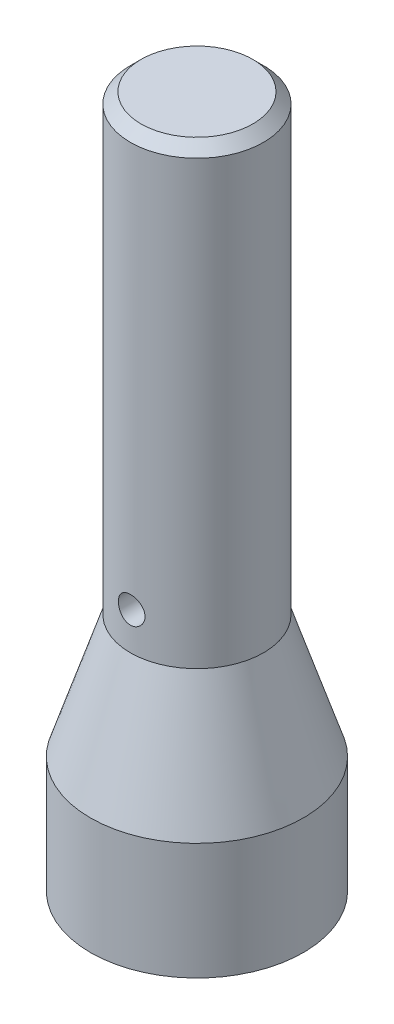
ISO-10303-21;
HEADER;
FILE_DESCRIPTION(('STEP AP214'),'2;1');
FILE_NAME('part.step','',(''),(''),'','','');
FILE_SCHEMA(('AUTOMOTIVE_DESIGN { 1 0 10303 214 1 1 1 1 }'));
ENDSEC;
DATA;
#1=APPLICATION_CONTEXT('core data for automotive mechanical design processes');
#2=APPLICATION_PROTOCOL_DEFINITION('international standard','automotive_design',2000,#1);
#3=PRODUCT_CONTEXT('',#1,'mechanical');
#4=PRODUCT('Part','Part','',(#3));
#5=PRODUCT_RELATED_PRODUCT_CATEGORY('part','',(#4));
#6=PRODUCT_DEFINITION_FORMATION('','',#4);
#7=PRODUCT_DEFINITION_CONTEXT('part definition',#1,'design');
#8=PRODUCT_DEFINITION('design','',#6,#7);
#9=PRODUCT_DEFINITION_SHAPE('','',#8);
#10=(LENGTH_UNIT() NAMED_UNIT(*) SI_UNIT(.MILLI.,.METRE.));
#11=(NAMED_UNIT(*) PLANE_ANGLE_UNIT() SI_UNIT($,.RADIAN.));
#12=(NAMED_UNIT(*) SI_UNIT($,.STERADIAN.) SOLID_ANGLE_UNIT());
#13=UNCERTAINTY_MEASURE_WITH_UNIT(LENGTH_MEASURE(1.E-05),#10,'distance_accuracy_value','');
#14=(GEOMETRIC_REPRESENTATION_CONTEXT(3) GLOBAL_UNCERTAINTY_ASSIGNED_CONTEXT((#13)) GLOBAL_UNIT_ASSIGNED_CONTEXT((#10,
#11,#12)) REPRESENTATION_CONTEXT('',''));
#15=CARTESIAN_POINT('',(0.,0.,0.));
#16=DIRECTION('',(0.,0.,1.));
#17=DIRECTION('',(1.,0.,0.));
#18=AXIS2_PLACEMENT_3D('',#15,#16,#17);
#19=CARTESIAN_POINT('',(0.,4.5,0.));
#20=DIRECTION('',(0.,-1.,0.));
#21=DIRECTION('',(0.,0.,-1.));
#22=AXIS2_PLACEMENT_3D('',#19,#20,#21);
#23=CYLINDRICAL_SURFACE('',#22,2.);
#24=CARTESIAN_POINT('',(0.,2.18999999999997,0.));
#25=DIRECTION('',(0.,1.,0.));
#26=DIRECTION('',(0.,0.,1.));
#27=AXIS2_PLACEMENT_3D('',#24,#25,#26);
#28=CIRCLE('',#27,2.);
#29=CARTESIAN_POINT('',(0.,2.18999999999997,2.));
#30=VERTEX_POINT('',#29);
#31=EDGE_CURVE('E145',#30,#30,#28,.F.);
#32=ORIENTED_EDGE('',*,*,#31,.T.);
#33=EDGE_LOOP('',(#32));
#34=FACE_BOUND('',#33,.T.);
#35=CARTESIAN_POINT('',(0.,0.,0.));
#36=DIRECTION('',(0.,1.,0.));
#37=DIRECTION('',(0.,0.,1.));
#38=AXIS2_PLACEMENT_3D('',#35,#36,#37);
#39=CIRCLE('',#38,2.);
#40=CARTESIAN_POINT('',(0.,0.,2.));
#41=VERTEX_POINT('',#40);
#42=EDGE_CURVE('E73',#41,#41,#39,.T.);
#43=ORIENTED_EDGE('',*,*,#42,.T.);
#44=EDGE_LOOP('',(#43));
#45=FACE_BOUND('',#44,.T.);
#46=ADVANCED_FACE('F34',(#34,#45),#23,.T.);
#47=CARTESIAN_POINT('',(0.,0.,0.));
#48=DIRECTION('',(0.,1.,0.));
#49=DIRECTION('',(0.,0.,1.));
#50=AXIS2_PLACEMENT_3D('',#47,#48,#49);
#51=PLANE('',#50);
#52=CARTESIAN_POINT('',(0.,0.,0.));
#53=DIRECTION('',(0.,-1.,0.));
#54=DIRECTION('',(0.,0.,-1.));
#55=AXIS2_PLACEMENT_3D('',#52,#53,#54);
#56=CIRCLE('',#55,0.79999999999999);
#57=CARTESIAN_POINT('',(0.,0.,-0.79999999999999));
#58=VERTEX_POINT('',#57);
#59=EDGE_CURVE('E58',#58,#58,#56,.T.);
#60=ORIENTED_EDGE('',*,*,#59,.F.);
#61=EDGE_LOOP('',(#60));
#62=FACE_BOUND('',#61,.T.);
#63=ORIENTED_EDGE('',*,*,#42,.F.);
#64=EDGE_LOOP('',(#63));
#65=FACE_BOUND('',#64,.T.);
#66=ADVANCED_FACE('F98',(#62,#65),#51,.F.);
#67=CARTESIAN_POINT('',(0.,4.5,0.));
#68=DIRECTION('',(0.,-1.,0.));
#69=DIRECTION('',(0.,0.,-1.));
#70=AXIS2_PLACEMENT_3D('',#67,#68,#69);
#71=CONICAL_SURFACE('',#70,1.24943550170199,0.314159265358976);
#72=ORIENTED_EDGE('',*,*,#31,.F.);
#73=EDGE_LOOP('',(#72));
#74=FACE_BOUND('',#73,.T.);
#75=CARTESIAN_POINT('',(0.,4.5,0.));
#76=DIRECTION('',(0.,1.,0.));
#77=DIRECTION('',(0.,0.,1.));
#78=AXIS2_PLACEMENT_3D('',#75,#76,#77);
#79=CIRCLE('',#78,1.25);
#80=CARTESIAN_POINT('',(0.,4.5,1.25));
#81=VERTEX_POINT('',#80);
#82=EDGE_CURVE('E78',#81,#81,#79,.T.);
#83=ORIENTED_EDGE('',*,*,#82,.F.);
#84=EDGE_LOOP('',(#83));
#85=FACE_BOUND('',#84,.T.);
#86=ADVANCED_FACE('F95',(#74,#85),#71,.T.);
#87=CARTESIAN_POINT('',(0.,13.,0.));
#88=DIRECTION('',(0.,-1.,0.));
#89=DIRECTION('',(0.,0.,-1.));
#90=AXIS2_PLACEMENT_3D('',#87,#88,#89);
#91=CYLINDRICAL_SURFACE('',#90,1.25);
#92=CARTESIAN_POINT('',(0.,12.8,0.));
#93=DIRECTION('',(0.,1.,0.));
#94=DIRECTION('',(0.,0.,1.));
#95=AXIS2_PLACEMENT_3D('',#92,#93,#94);
#96=CIRCLE('',#95,1.25);
#97=CARTESIAN_POINT('',(0.,12.8,1.25));
#98=VERTEX_POINT('',#97);
#99=EDGE_CURVE('E11',#98,#98,#96,.F.);
#100=ORIENTED_EDGE('',*,*,#99,.T.);
#101=EDGE_LOOP('',(#100));
#102=FACE_BOUND('',#101,.T.);
#103=CARTESIAN_POINT('',(-0.249999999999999,5.2,1.22474487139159));
#104=CARTESIAN_POINT('',(-0.24999948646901,5.21389109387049,1.22474514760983));
#105=CARTESIAN_POINT('',(-0.248838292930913,5.22778865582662,1.22498377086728));
#106=CARTESIAN_POINT('',(-0.244228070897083,5.2551906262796,1.22591107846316));
#107=CARTESIAN_POINT('',(-0.240777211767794,5.26869471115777,1.22660012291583));
#108=CARTESIAN_POINT('',(-0.231698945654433,5.29490932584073,1.22834718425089));
#109=CARTESIAN_POINT('',(-0.226073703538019,5.30762063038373,1.22940483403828));
#110=CARTESIAN_POINT('',(-0.212812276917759,5.33191871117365,1.23176949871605));
#111=CARTESIAN_POINT('',(-0.205176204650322,5.34350555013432,1.23307649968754));
#112=CARTESIAN_POINT('',(-0.187994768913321,5.36539025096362,1.2358132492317));
#113=CARTESIAN_POINT('',(-0.178426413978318,5.37566989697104,1.23724434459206));
#114=CARTESIAN_POINT('',(-0.157701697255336,5.3944893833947,1.24005618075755));
#115=CARTESIAN_POINT('',(-0.146545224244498,5.40302910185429,1.24143691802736));
#116=CARTESIAN_POINT('',(-0.12284033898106,5.41819700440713,1.24400699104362));
#117=CARTESIAN_POINT('',(-0.110280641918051,5.42480787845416,1.2451945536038));
#118=CARTESIAN_POINT('',(-0.0842010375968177,5.43581873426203,1.24722934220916));
#119=CARTESIAN_POINT('',(-0.0706812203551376,5.44021892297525,1.24807660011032));
#120=CARTESIAN_POINT('',(-0.0432541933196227,5.44662679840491,1.24932580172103));
#121=CARTESIAN_POINT('',(-0.0293544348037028,5.44866524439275,1.24973346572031));
#122=CARTESIAN_POINT('',(-0.00140464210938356,5.45038773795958,1.25007730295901));
#123=CARTESIAN_POINT('',(0.0126453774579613,5.45007201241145,1.2500135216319));
#124=CARTESIAN_POINT('',(0.0402855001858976,5.44711845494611,1.24942608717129));
#125=CARTESIAN_POINT('',(0.053879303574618,5.44451375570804,1.2489089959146));
#126=CARTESIAN_POINT('',(0.0804329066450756,5.43710874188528,1.24748044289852));
#127=CARTESIAN_POINT('',(0.0933926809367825,5.43230833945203,1.2465689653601));
#128=CARTESIAN_POINT('',(0.118404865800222,5.42061748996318,1.2444432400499));
#129=CARTESIAN_POINT('',(0.130451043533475,5.41371406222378,1.24322712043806));
#130=CARTESIAN_POINT('',(0.153226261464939,5.39802273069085,1.24062617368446));
#131=CARTESIAN_POINT('',(0.16395514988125,5.38923461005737,1.23924132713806));
#132=CARTESIAN_POINT('',(0.183987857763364,5.36984159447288,1.23642741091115));
#133=CARTESIAN_POINT('',(0.193263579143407,5.3592077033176,1.23499799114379));
#134=CARTESIAN_POINT('',(0.209904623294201,5.33652088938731,1.2322789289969));
#135=CARTESIAN_POINT('',(0.217269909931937,5.3244679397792,1.23098928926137));
#136=CARTESIAN_POINT('',(0.22989070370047,5.29924479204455,1.22869511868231));
#137=CARTESIAN_POINT('',(0.235141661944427,5.28607225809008,1.22769120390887));
#138=CARTESIAN_POINT('',(0.243347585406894,5.259007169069,1.22609119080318));
#139=CARTESIAN_POINT('',(0.24630284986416,5.24511470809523,1.22549503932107));
#140=CARTESIAN_POINT('',(0.249791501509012,5.21725878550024,1.22478869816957));
#141=CARTESIAN_POINT('',(0.250365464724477,5.20330060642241,1.22467036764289));
#142=CARTESIAN_POINT('',(0.249184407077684,5.17548794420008,1.22491121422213));
#143=CARTESIAN_POINT('',(0.247429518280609,5.16163345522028,1.22527036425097));
#144=CARTESIAN_POINT('',(0.241675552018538,5.13455783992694,1.22641808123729));
#145=CARTESIAN_POINT('',(0.237698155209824,5.12133191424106,1.22720249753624));
#146=CARTESIAN_POINT('',(0.227635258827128,5.09573418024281,1.22910872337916));
#147=CARTESIAN_POINT('',(0.221549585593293,5.08336244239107,1.23023056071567));
#148=CARTESIAN_POINT('',(0.207351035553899,5.05964672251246,1.2327035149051));
#149=CARTESIAN_POINT('',(0.199212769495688,5.04831823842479,1.23405742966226));
#150=CARTESIAN_POINT('',(0.181173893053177,5.02717292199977,1.23683430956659));
#151=CARTESIAN_POINT('',(0.171273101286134,5.01735624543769,1.23825728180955));
#152=CARTESIAN_POINT('',(0.149808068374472,4.99935936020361,1.24103836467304));
#153=CARTESIAN_POINT('',(0.138220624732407,4.9912065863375,1.24239514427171));
#154=CARTESIAN_POINT('',(0.113816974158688,4.97696352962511,1.24486781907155));
#155=CARTESIAN_POINT('',(0.101000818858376,4.97087316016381,1.24598372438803));
#156=CARTESIAN_POINT('',(0.0745756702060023,4.96096778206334,1.24784323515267));
#157=CARTESIAN_POINT('',(0.0609716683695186,4.95713987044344,1.24858894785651));
#158=CARTESIAN_POINT('',(0.0332973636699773,4.95182718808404,1.24963308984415));
#159=CARTESIAN_POINT('',(0.0192271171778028,4.95034213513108,1.24993157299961));
#160=CARTESIAN_POINT('',(-0.00871822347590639,4.94976825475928,1.2500463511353));
#161=CARTESIAN_POINT('',(-0.022592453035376,4.95063817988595,1.24987094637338));
#162=CARTESIAN_POINT('',(-0.0499927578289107,4.95465848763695,1.24907510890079));
#163=CARTESIAN_POINT('',(-0.0635188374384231,4.95780884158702,1.24845468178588));
#164=CARTESIAN_POINT('',(-0.0898131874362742,4.96628224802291,1.2468387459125));
#165=CARTESIAN_POINT('',(-0.10258311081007,4.9716003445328,1.24584409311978));
#166=CARTESIAN_POINT('',(-0.127055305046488,4.98425306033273,1.24358680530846));
#167=CARTESIAN_POINT('',(-0.138757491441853,4.99158783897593,1.24232414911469));
#168=CARTESIAN_POINT('',(-0.160965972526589,5.00820484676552,1.23964399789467));
#169=CARTESIAN_POINT('',(-0.171449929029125,5.01751658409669,1.23822433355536));
#170=CARTESIAN_POINT('',(-0.190720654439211,5.03776256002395,1.23540305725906));
#171=CARTESIAN_POINT('',(-0.199507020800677,5.04869718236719,1.23400144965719));
#172=CARTESIAN_POINT('',(-0.2152230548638,5.07201982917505,1.23135835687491));
#173=CARTESIAN_POINT('',(-0.222131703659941,5.08442224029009,1.23011875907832));
#174=CARTESIAN_POINT('',(-0.233756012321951,5.11023319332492,1.22796309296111));
#175=CARTESIAN_POINT('',(-0.238473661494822,5.12364080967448,1.22704673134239));
#176=CARTESIAN_POINT('',(-0.244667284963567,5.14756561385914,1.2258242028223));
#177=CARTESIAN_POINT('',(-0.246663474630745,5.15794635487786,1.22542196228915));
#178=CARTESIAN_POINT('',(-0.249330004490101,5.17888348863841,1.22488219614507));
#179=CARTESIAN_POINT('',(-0.250000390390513,5.18943987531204,1.22474466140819));
#180=CARTESIAN_POINT('',(-0.249999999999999,5.2,1.22474487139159));
#181=B_SPLINE_CURVE_WITH_KNOTS('',3,(#103,#104,#105,#106,#107,#108,#109,#110,#111,#112,#113,
#114,#115,#116,#117,#118,#119,#120,#121,#122,#123,#124,#125,#126,#127,#128,#129,#130,#131,#132,
#133,#134,#135,#136,#137,#138,#139,#140,#141,#142,#143,#144,#145,#146,#147,#148,#149,#150,#151,
#152,#153,#154,#155,#156,#157,#158,#159,#160,#161,#162,#163,#164,#165,#166,#167,#168,#169,#170,
#171,#172,#173,#174,#175,#176,#177,#178,#179,#180),.UNSPECIFIED.,.T.,.F.,(4,2,2,2,2,2,2,2,2,2,2,
2,2,2,2,2,2,2,2,2,2,2,2,2,2,2,2,2,2,2,2,2,2,2,2,2,2,2,4),(0.,0.0416346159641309,
0.0833025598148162,0.124929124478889,0.166553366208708,0.208705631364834,0.250860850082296,
0.293383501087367,0.33590217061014,0.377860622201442,0.419815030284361,0.461171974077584,
0.502530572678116,0.544149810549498,0.585773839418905,0.628123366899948,0.67047369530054,
0.712914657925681,0.755350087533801,0.797059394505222,0.838766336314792,0.880073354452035,
0.921383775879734,0.96323264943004,1.00508583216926,1.04758150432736,1.090075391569,
1.13232453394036,1.17456858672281,1.21607754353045,1.25758597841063,1.29900004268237,
1.34041738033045,1.38250288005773,1.42459834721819,1.46714724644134,1.50965743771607,
1.54130950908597,1.57296048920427),.UNSPECIFIED.);
#182=CARTESIAN_POINT('',(-0.249999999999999,5.2,1.22474487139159));
#183=VERTEX_POINT('',#182);
#184=EDGE_CURVE('E61',#183,#183,#181,.T.);
#185=ORIENTED_EDGE('',*,*,#184,.T.);
#186=EDGE_LOOP('',(#185));
#187=FACE_BOUND('',#186,.T.);
#188=ORIENTED_EDGE('',*,*,#82,.T.);
#189=EDGE_LOOP('',(#188));
#190=FACE_BOUND('',#189,.T.);
#191=ADVANCED_FACE('F84',(#102,#187,#190),#91,.T.);
#192=CARTESIAN_POINT('',(0.,13.,0.));
#193=DIRECTION('',(0.,1.,0.));
#194=DIRECTION('',(0.,0.,1.));
#195=AXIS2_PLACEMENT_3D('',#192,#193,#194);
#196=PLANE('',#195);
#197=CARTESIAN_POINT('',(0.,13.,0.));
#198=DIRECTION('',(0.,1.,0.));
#199=DIRECTION('',(0.,0.,1.));
#200=AXIS2_PLACEMENT_3D('',#197,#198,#199);
#201=CIRCLE('',#200,1.05);
#202=CARTESIAN_POINT('',(0.,13.,1.05));
#203=VERTEX_POINT('',#202);
#204=EDGE_CURVE('E41',#203,#203,#201,.T.);
#205=ORIENTED_EDGE('',*,*,#204,.T.);
#206=EDGE_LOOP('',(#205));
#207=FACE_BOUND('',#206,.T.);
#208=ADVANCED_FACE('F94',(#207),#196,.T.);
#209=CARTESIAN_POINT('',(0.,3.,0.));
#210=DIRECTION('',(0.,-1.,0.));
#211=DIRECTION('',(0.,0.,-1.));
#212=AXIS2_PLACEMENT_3D('',#209,#210,#211);
#213=CONICAL_SURFACE('',#212,0.799999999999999,0.785398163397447);
#214=CARTESIAN_POINT('',(0.,3.3,0.));
#215=DIRECTION('',(0.,-1.,0.));
#216=DIRECTION('',(0.,0.,-1.));
#217=AXIS2_PLACEMENT_3D('',#214,#215,#216);
#218=CIRCLE('',#217,0.499999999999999);
#219=CARTESIAN_POINT('',(0.,3.3,-0.499999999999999));
#220=VERTEX_POINT('',#219);
#221=EDGE_CURVE('E54',#220,#220,#218,.F.);
#222=ORIENTED_EDGE('',*,*,#221,.T.);
#223=EDGE_LOOP('',(#222));
#224=FACE_BOUND('',#223,.T.);
#225=CARTESIAN_POINT('',(0.,3.,0.));
#226=DIRECTION('',(0.,-1.,0.));
#227=DIRECTION('',(0.,0.,-1.));
#228=AXIS2_PLACEMENT_3D('',#225,#226,#227);
#229=CIRCLE('',#228,0.799999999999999);
#230=CARTESIAN_POINT('',(0.,3.,-0.799999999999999));
#231=VERTEX_POINT('',#230);
#232=EDGE_CURVE('E70',#231,#231,#229,.T.);
#233=ORIENTED_EDGE('',*,*,#232,.T.);
#234=EDGE_LOOP('',(#233));
#235=FACE_BOUND('',#234,.T.);
#236=ADVANCED_FACE('F116',(#224,#235),#213,.F.);
#237=CARTESIAN_POINT('',(0.,0.,0.));
#238=DIRECTION('',(0.,-1.,0.));
#239=DIRECTION('',(0.,0.,-1.));
#240=AXIS2_PLACEMENT_3D('',#237,#238,#239);
#241=CYLINDRICAL_SURFACE('',#240,0.799999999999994);
#242=ORIENTED_EDGE('',*,*,#232,.F.);
#243=EDGE_LOOP('',(#242));
#244=FACE_BOUND('',#243,.T.);
#245=ORIENTED_EDGE('',*,*,#59,.T.);
#246=EDGE_LOOP('',(#245));
#247=FACE_BOUND('',#246,.T.);
#248=ADVANCED_FACE('F112',(#244,#247),#241,.F.);
#249=CARTESIAN_POINT('',(0.,0.,0.));
#250=DIRECTION('',(0.,-1.,0.));
#251=DIRECTION('',(0.,0.,-1.));
#252=AXIS2_PLACEMENT_3D('',#249,#250,#251);
#253=CYLINDRICAL_SURFACE('',#252,0.499999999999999);
#254=CARTESIAN_POINT('',(-0.249999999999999,5.2,0.433012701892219));
#255=CARTESIAN_POINT('',(-0.24999909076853,5.18697304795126,0.433013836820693));
#256=CARTESIAN_POINT('',(-0.248974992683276,5.17392964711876,0.433609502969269));
#257=CARTESIAN_POINT('',(-0.24493080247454,5.14824318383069,0.435905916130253));
#258=CARTESIAN_POINT('',(-0.241906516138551,5.13560102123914,0.437608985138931));
#259=CARTESIAN_POINT('',(-0.234024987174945,5.11113708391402,0.441873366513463));
#260=CARTESIAN_POINT('',(-0.229177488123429,5.0993113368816,0.444430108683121));
#261=CARTESIAN_POINT('',(-0.217816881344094,5.07664394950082,0.450106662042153));
#262=CARTESIAN_POINT('',(-0.211303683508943,5.06580236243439,0.453226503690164));
#263=CARTESIAN_POINT('',(-0.196166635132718,5.04442356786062,0.459992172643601));
#264=CARTESIAN_POINT('',(-0.187413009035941,5.03398521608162,0.463660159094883));
#265=CARTESIAN_POINT('',(-0.168313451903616,5.01464790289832,0.470929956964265));
#266=CARTESIAN_POINT('',(-0.157966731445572,5.00574970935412,0.474531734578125));
#267=CARTESIAN_POINT('',(-0.135122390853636,4.98915821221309,0.481553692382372));
#268=CARTESIAN_POINT('',(-0.122526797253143,4.98158655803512,0.48494526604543));
#269=CARTESIAN_POINT('',(-0.0960392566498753,4.96871478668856,0.490876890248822));
#270=CARTESIAN_POINT('',(-0.082148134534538,4.96341323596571,0.493417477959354));
#271=CARTESIAN_POINT('',(-0.0545112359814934,4.95562383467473,0.497201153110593));
#272=CARTESIAN_POINT('',(-0.0408254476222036,4.95296261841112,0.498523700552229));
#273=CARTESIAN_POINT('',(-0.0131426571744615,4.94995847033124,0.500018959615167));
#274=CARTESIAN_POINT('',(0.000854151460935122,4.94961413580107,0.500192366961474));
#275=CARTESIAN_POINT('',(0.0274581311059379,4.95118666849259,0.499407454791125));
#276=CARTESIAN_POINT('',(0.0400802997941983,4.95290950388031,0.4985462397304));
#277=CARTESIAN_POINT('',(0.0648284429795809,4.95822021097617,0.495935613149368));
#278=CARTESIAN_POINT('',(0.0769543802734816,4.96180822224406,0.494186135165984));
#279=CARTESIAN_POINT('',(0.100577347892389,4.97077064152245,0.489928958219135));
#280=CARTESIAN_POINT('',(0.112063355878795,4.97616907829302,0.487411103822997));
#281=CARTESIAN_POINT('',(0.133994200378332,4.98856585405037,0.481844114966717));
#282=CARTESIAN_POINT('',(0.144438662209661,4.99556476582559,0.47879479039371));
#283=CARTESIAN_POINT('',(0.165043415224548,5.01172383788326,0.472110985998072));
#284=CARTESIAN_POINT('',(0.17508351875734,5.0210257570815,0.468448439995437));
#285=CARTESIAN_POINT('',(0.193526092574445,5.04114743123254,0.461135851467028));
#286=CARTESIAN_POINT('',(0.201927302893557,5.05196834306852,0.457485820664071));
#287=CARTESIAN_POINT('',(0.217376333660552,5.07566204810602,0.450360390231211));
#288=CARTESIAN_POINT('',(0.224304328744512,5.08862150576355,0.446910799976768));
#289=CARTESIAN_POINT('',(0.235829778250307,5.11573441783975,0.440938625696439));
#290=CARTESIAN_POINT('',(0.240429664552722,5.12988660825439,0.438415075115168));
#291=CARTESIAN_POINT('',(0.246795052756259,5.1578036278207,0.434861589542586));
#292=CARTESIAN_POINT('',(0.248756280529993,5.17151027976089,0.433729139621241));
#293=CARTESIAN_POINT('',(0.250379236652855,5.19910033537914,0.432794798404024));
#294=CARTESIAN_POINT('',(0.250042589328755,5.21298360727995,0.432991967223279));
#295=CARTESIAN_POINT('',(0.24725901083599,5.23891347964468,0.434585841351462));
#296=CARTESIAN_POINT('',(0.245046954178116,5.25099486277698,0.435848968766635));
#297=CARTESIAN_POINT('',(0.238924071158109,5.27459194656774,0.439235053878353));
#298=CARTESIAN_POINT('',(0.235012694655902,5.28610746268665,0.441358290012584));
#299=CARTESIAN_POINT('',(0.22541189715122,5.30885283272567,0.446340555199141));
#300=CARTESIAN_POINT('',(0.21964851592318,5.32004475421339,0.449229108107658));
#301=CARTESIAN_POINT('',(0.20657176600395,5.34136731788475,0.455390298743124));
#302=CARTESIAN_POINT('',(0.199257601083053,5.35149741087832,0.458663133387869));
#303=CARTESIAN_POINT('',(0.182209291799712,5.37174469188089,0.46571999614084));
#304=CARTESIAN_POINT('',(0.17228631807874,5.38169928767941,0.469516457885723));
#305=CARTESIAN_POINT('',(0.150851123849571,5.3998530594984,0.47683558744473));
#306=CARTESIAN_POINT('',(0.139338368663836,5.40805164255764,0.48035816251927));
#307=CARTESIAN_POINT('',(0.114633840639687,5.42264343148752,0.486853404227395));
#308=CARTESIAN_POINT('',(0.101405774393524,5.42898327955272,0.489809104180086));
#309=CARTESIAN_POINT('',(0.073880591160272,5.43928447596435,0.494708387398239));
#310=CARTESIAN_POINT('',(0.0595844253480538,5.44324791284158,0.496652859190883));
#311=CARTESIAN_POINT('',(0.0317449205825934,5.44834214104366,0.499168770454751));
#312=CARTESIAN_POINT('',(0.0182528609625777,5.449699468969,0.499849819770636));
#313=CARTESIAN_POINT('',(-0.00878149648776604,5.45021081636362,0.500105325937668));
#314=CARTESIAN_POINT('',(-0.0223237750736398,5.44936560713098,0.499680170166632));
#315=CARTESIAN_POINT('',(-0.0481344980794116,5.44564589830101,0.497834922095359));
#316=CARTESIAN_POINT('',(-0.0604280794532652,5.44290878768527,0.496482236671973));
#317=CARTESIAN_POINT('',(-0.0843614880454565,5.43566825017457,0.492980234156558));
#318=CARTESIAN_POINT('',(-0.0960012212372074,5.4311645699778,0.490830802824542));
#319=CARTESIAN_POINT('',(-0.118855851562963,5.42031823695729,0.485814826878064));
#320=CARTESIAN_POINT('',(-0.13003128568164,5.41390516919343,0.482921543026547));
#321=CARTESIAN_POINT('',(-0.151193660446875,5.39951051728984,0.476720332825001));
#322=CARTESIAN_POINT('',(-0.161180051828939,5.3915282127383,0.473412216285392));
#323=CARTESIAN_POINT('',(-0.180728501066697,5.37330071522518,0.466321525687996));
#324=CARTESIAN_POINT('',(-0.190149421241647,5.3629093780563,0.462524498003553));
#325=CARTESIAN_POINT('',(-0.207165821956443,5.34063731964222,0.455157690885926));
#326=CARTESIAN_POINT('',(-0.214759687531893,5.32875529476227,0.451588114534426));
#327=CARTESIAN_POINT('',(-0.228107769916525,5.30334083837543,0.444999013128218));
#328=CARTESIAN_POINT('',(-0.233796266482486,5.28976811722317,0.442000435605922));
#329=CARTESIAN_POINT('',(-0.242719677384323,5.26166689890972,0.437165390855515));
#330=CARTESIAN_POINT('',(-0.245962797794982,5.24714177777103,0.435325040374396));
#331=CARTESIAN_POINT('',(-0.248591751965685,5.22704866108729,0.433823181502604));
#332=CARTESIAN_POINT('',(-0.249119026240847,5.22165802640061,0.433520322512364));
#333=CARTESIAN_POINT('',(-0.249823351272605,5.21084587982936,0.433114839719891));
#334=CARTESIAN_POINT('',(-0.250000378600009,5.2054243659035,0.433012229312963));
#335=CARTESIAN_POINT('',(-0.249999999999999,5.2,0.433012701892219));
#336=B_SPLINE_CURVE_WITH_KNOTS('',3,(#254,#255,#256,#257,#258,#259,#260,#261,#262,#263,#264,
#265,#266,#267,#268,#269,#270,#271,#272,#273,#274,#275,#276,#277,#278,#279,#280,#281,#282,#283,
#284,#285,#286,#287,#288,#289,#290,#291,#292,#293,#294,#295,#296,#297,#298,#299,#300,#301,#302,
#303,#304,#305,#306,#307,#308,#309,#310,#311,#312,#313,#314,#315,#316,#317,#318,#319,#320,#321,
#322,#323,#324,#325,#326,#327,#328,#329,#330,#331,#332,#333,#334,#335),.UNSPECIFIED.,.T.,.F.,(4,
2,2,2,2,2,2,2,2,2,2,2,2,2,2,2,2,2,2,2,2,2,2,2,2,2,2,2,2,2,2,2,2,2,2,2,2,2,2,2,4),(0.,
0.0390580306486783,0.0781982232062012,0.117132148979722,0.156068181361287,0.198215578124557,
0.240383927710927,0.285394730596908,0.330377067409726,0.372158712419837,0.413915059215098,
0.452040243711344,0.490168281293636,0.528823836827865,0.567493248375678,0.609817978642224,
0.652175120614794,0.69722210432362,0.74222193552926,0.783655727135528,0.82506023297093,
0.861935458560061,0.898822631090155,0.937418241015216,0.976033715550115,1.01951685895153,
1.0630146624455,1.10766045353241,1.15226694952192,1.19278067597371,1.23328021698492,
1.27111106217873,1.30894733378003,1.34840187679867,1.38787457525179,1.43127560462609,
1.47471485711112,1.51952687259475,1.56418783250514,1.58045033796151,1.59671393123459),.UNSPECIFIED.);
#337=CARTESIAN_POINT('',(-0.249999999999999,5.2,0.433012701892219));
#338=VERTEX_POINT('',#337);
#339=EDGE_CURVE('E55',#338,#338,#336,.T.);
#340=ORIENTED_EDGE('',*,*,#339,.T.);
#341=EDGE_LOOP('',(#340));
#342=FACE_BOUND('',#341,.T.);
#343=CARTESIAN_POINT('',(0.,6.,0.));
#344=DIRECTION('',(0.,-1.,0.));
#345=DIRECTION('',(0.,0.,-1.));
#346=AXIS2_PLACEMENT_3D('',#343,#344,#345);
#347=CIRCLE('',#346,0.499999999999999);
#348=CARTESIAN_POINT('',(0.,6.,-0.499999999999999));
#349=VERTEX_POINT('',#348);
#350=EDGE_CURVE('E52',#349,#349,#347,.T.);
#351=ORIENTED_EDGE('',*,*,#350,.F.);
#352=EDGE_LOOP('',(#351));
#353=FACE_BOUND('',#352,.T.);
#354=ORIENTED_EDGE('',*,*,#221,.F.);
#355=EDGE_LOOP('',(#354));
#356=FACE_BOUND('',#355,.T.);
#357=ADVANCED_FACE('F48',(#342,#353,#356),#253,.F.);
#358=CARTESIAN_POINT('',(0.,6.,0.));
#359=DIRECTION('',(0.,-1.,0.));
#360=DIRECTION('',(0.,0.,-1.));
#361=AXIS2_PLACEMENT_3D('',#358,#359,#360);
#362=CONICAL_SURFACE('',#361,0.499999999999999,0.785398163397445);
#363=CARTESIAN_POINT('',(0.,6.5,0.));
#364=VERTEX_POINT('',#363);
#365=VERTEX_LOOP('',#364);
#366=FACE_BOUND('',#365,.T.);
#367=ORIENTED_EDGE('',*,*,#350,.T.);
#368=EDGE_LOOP('',(#367));
#369=FACE_BOUND('',#368,.T.);
#370=ADVANCED_FACE('F44',(#366,#369),#362,.F.);
#371=CARTESIAN_POINT('',(0.,5.2,0.));
#372=DIRECTION('',(0.,0.,-1.));
#373=DIRECTION('',(-1.,0.,0.));
#374=AXIS2_PLACEMENT_3D('',#371,#372,#373);
#375=CYLINDRICAL_SURFACE('',#374,0.249999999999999);
#376=ORIENTED_EDGE('',*,*,#184,.F.);
#377=EDGE_LOOP('',(#376));
#378=FACE_BOUND('',#377,.T.);
#379=ORIENTED_EDGE('',*,*,#339,.F.);
#380=EDGE_LOOP('',(#379));
#381=FACE_BOUND('',#380,.T.);
#382=ADVANCED_FACE('F47',(#378,#381),#375,.F.);
#383=CARTESIAN_POINT('',(0.,13.,0.));
#384=DIRECTION('',(0.,-1.,0.));
#385=DIRECTION('',(0.,0.,-1.));
#386=AXIS2_PLACEMENT_3D('',#383,#384,#385);
#387=CONICAL_SURFACE('',#386,1.05,0.78539816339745);
#388=ORIENTED_EDGE('',*,*,#99,.F.);
#389=EDGE_LOOP('',(#388));
#390=FACE_BOUND('',#389,.T.);
#391=ORIENTED_EDGE('',*,*,#204,.F.);
#392=EDGE_LOOP('',(#391));
#393=FACE_BOUND('',#392,.T.);
#394=ADVANCED_FACE('F36',(#390,#393),#387,.T.);
#395=CLOSED_SHELL('',(#46,#66,#86,#191,#208,#236,#248,#357,#370,#382,#394));
#396=MANIFOLD_SOLID_BREP('B2',#395);
#397=ADVANCED_BREP_SHAPE_REPRESENTATION('',(#18,#396),#14);
#398=SHAPE_DEFINITION_REPRESENTATION(#9,#397);
ENDSEC;
END-ISO-10303-21;
